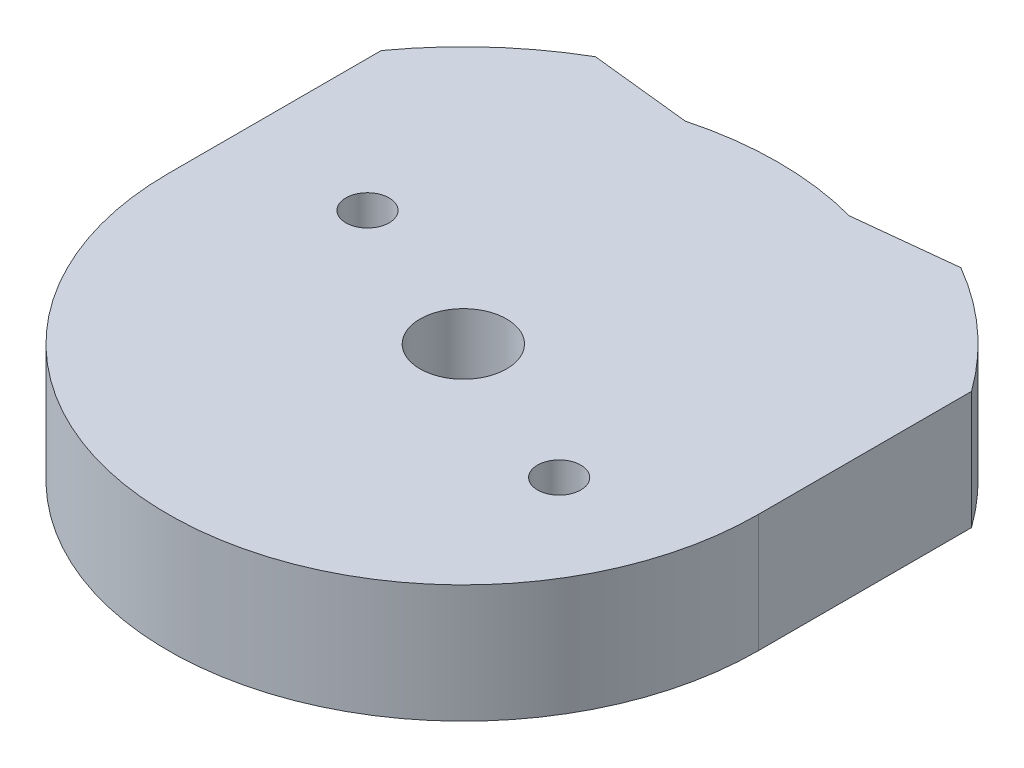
from build123d import *

# Parameters (mm, degrees)
ESQUISSE1_R      = 2.2
ESQUISSE1_R_2    = 1.1
EXTRUSION1_DEPTH = 6


with BuildPart() as part:
    # Esquisse1 → Extrusion1 (new body)
    with BuildSketch(Plane(origin=(0, 0, 0), x_dir=(1, 0, 0), z_dir=(0, 1, 0))):
        with BuildLine():
            Line((15, 0), (15, 10.828203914))
            ThreePointArc((15, 10.828203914), (12.415817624, 13.714863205), (9.287087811, 16))
            Line((9.287087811, 16), (4.164784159, 15.448448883))
            ThreePointArc((4.164784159, 15.448448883), (0, 16), (-4.164784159, 15.448448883))
            Line((-4.164784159, 15.448448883), (-9.287087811, 16))
            ThreePointArc((-9.287087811, 16), (-12.415817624, 13.714863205), (-15, 10.828203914))
            Line((-15, 10.828203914), (-15, 0))
            ThreePointArc((-15, 0), (0, -15), (15, 0))
        make_face()
        with Locations(Location((0, 0, 0), (0, 0, 270))):
            Circle(ESQUISSE1_R, mode=Mode.SUBTRACT)
        with Locations(Location((8.314915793, -3.444150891, 0), (0, 0, 270))):
            Circle(ESQUISSE1_R_2, mode=Mode.SUBTRACT)
        with Locations(Location((-8.314915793, 3.444150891, 0), (0, 0, 270))):
            Circle(ESQUISSE1_R_2, mode=Mode.SUBTRACT)
    extrude(amount=EXTRUSION1_DEPTH)


solid = part.part
